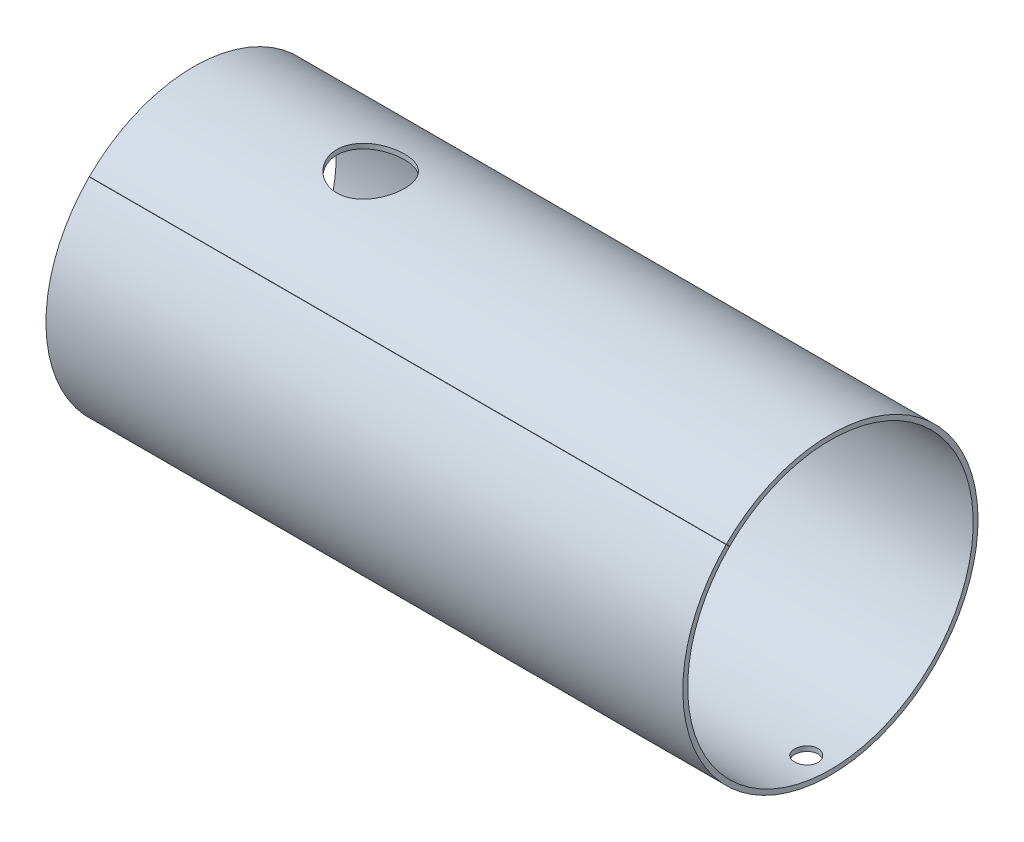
from build123d import *

# Parameters (mm, degrees)
EXTRU_MINCE1_DEPTH           = 550
EXTRU_MINCE1_DEPTH_BACK      = 766
ESQUISSE1_R                  = 305
ESQUISSE1_R_2                = 295
ESQUISSE3_R                  = 24.15
ENL_V_MAT_EXTRU_2_DEPTH      = 1995.437456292
ESQUISSE6_R                  = 69.85
ENL_V_MAT_EXTRU_3_DEPTH      = 700
ENL_V_MAT_EXTRU_4_DEPTH      = 880.093851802
ENL_V_MAT_EXTRU_4_DEPTH_BACK = 880.093851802


with BuildPart() as part:
    # Esquisse1 → Extru.-Mince1 (new, two sides: drawn at the far end of the back side and taken through both)
    with BuildSketch(Plane(origin=(0, 0, 0), x_dir=(0, 0, -1), z_dir=(1, 0, 0)).offset(-EXTRU_MINCE1_DEPTH_BACK)):
        Circle(ESQUISSE1_R)
        Circle(ESQUISSE1_R_2, mode=Mode.SUBTRACT)
    extrude(amount=EXTRU_MINCE1_DEPTH + EXTRU_MINCE1_DEPTH_BACK)

    # Esquisse3 → Enl_v. mat.-Extru.2 (cut)
    with BuildSketch(Plane(origin=(0, 0, 0), x_dir=(1, 0, 0), z_dir=(0, 1, 0))):
        with Locations(Location((500, 0, 0), (0, 0, 270))):
            Circle(ESQUISSE3_R)
    extrude(amount=-ENL_V_MAT_EXTRU_2_DEPTH, mode=Mode.SUBTRACT)

    # Esquisse6 → Enl_v. mat.-Extru.3 (cut)
    with BuildSketch(Plane(origin=(0, 0, 0), x_dir=(1, 0, 0), z_dir=(0, 1, 0))):
        with Locations(Location((-400, 0, 0), (0, 0, 90))):
            Circle(ESQUISSE6_R)
    extrude(amount=ENL_V_MAT_EXTRU_3_DEPTH, mode=Mode.SUBTRACT)

    # Esquisse7 → Enl_v. mat.-Extru.4 (cut, two sides: drawn at the far end of the back side and taken through both)
    with BuildSketch(Plane(origin=(0, 0, 0), x_dir=(0, 0, -1), z_dir=(1, 0, 0)).offset(-ENL_V_MAT_EXTRU_4_DEPTH_BACK)):
        Polygon((0, 0), (-393.589206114, 393.589206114), (-370.774914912, 372.07142768), align=None)
    extrude(amount=ENL_V_MAT_EXTRU_4_DEPTH + ENL_V_MAT_EXTRU_4_DEPTH_BACK, mode=Mode.SUBTRACT)


solid = part.part
